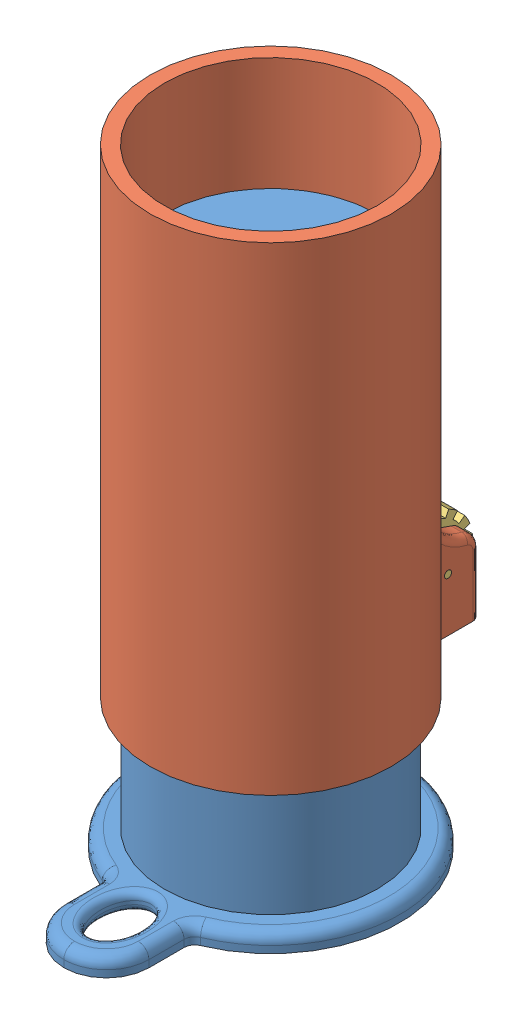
SolidWorks assembly Assem1.sldasm, configuration Default (file format 13000). Lengths in mm.
Overall size (92.43 218.38 146.24).
3 component instances, 3 part files, 4 mates.
Components (placement in the parent):
- inside cylinder-1: inside cylinder.SLDPRT [Default] at (-10.5639 -85.7455 -10.5162) size (92.43 177.8 120.33)
- outside cylinder-1: outside cylinder.SLDPRT [Default] at (-10.5639 -38.8194 -10.5162) x (0 0 -1) z (1 0 0) size (105.41 171.45 86.36)
- gear-2: gear.SLDPRT [Default] at (-4.2139 -19.7694 -61.3162) x (0 0.597947 -0.801536) z (-1 0 0) size (30.48 30.42 25.4)
Mates (geometry in assembly coordinates):
- Concentric1: concentric anti-aligned: cylinder of inside cylinder-1 through (-10.5639 92.0545 -10.5162) axis (0 -1 0) radius 38.1; cylinder of outside cylinder-1 through (-10.5639 -38.8194 -10.5162) axis (0 1 0) radius 38.1
- Coincident1: coincident: line of inside cylinder-1 through (-4.2139 -76.0367 -46.0762) axis (0 -1 0); plane of outside cylinder-1 through (-4.2139 -38.8194 32.6648) normal (-1 0 0)
- Concentric2: concentric anti-aligned: cylinder of outside cylinder-1 through (-53.7439 -19.7694 -61.3162) axis (1 0 0) radius 1.27; cylinder of gear-2 through (2.1361 -19.7694 -61.3162) axis (-1 0 0) radius 1.27
- Coincident3: coincident anti-aligned: plane of outside cylinder-1 through (2.1361 -38.8194 -72.7462) normal (1 0 0); circle of gear-2
